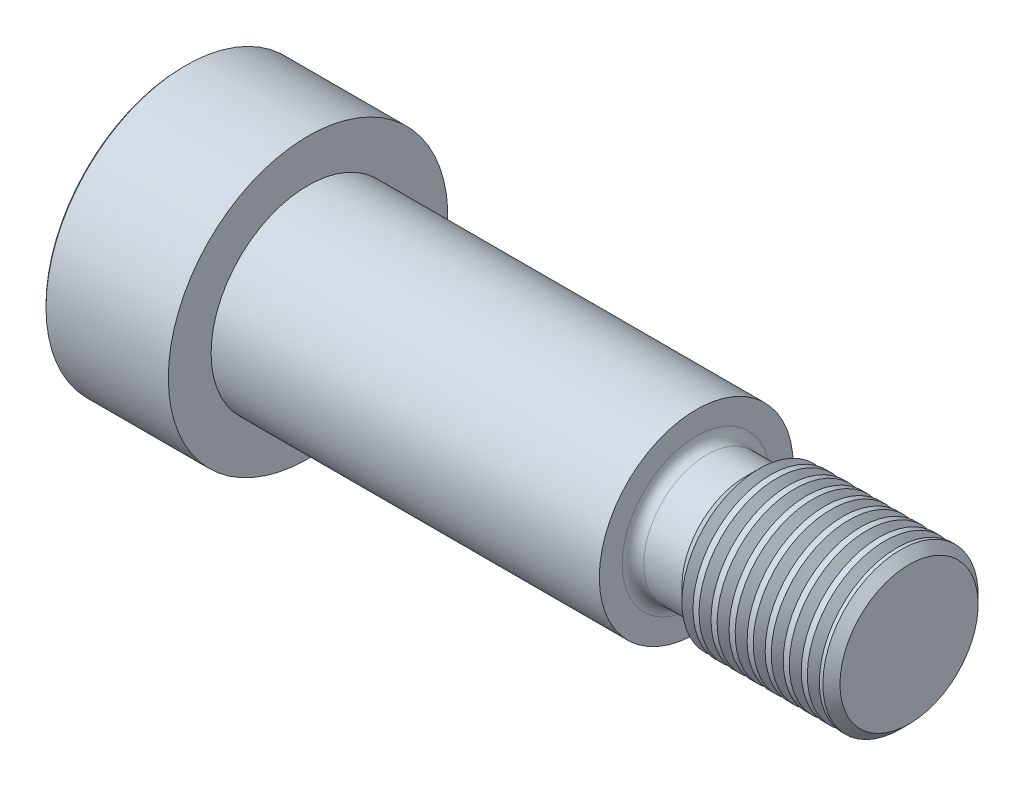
from build123d import *

# Parameters (mm, degrees)
CHAMFER1_SIZE   = 0.25
HEX_2_DEPTH     = 10
THDSCHPAT_COUNT = 8
THDSCHPAT_PITCH = 2.325


with BuildPart() as part:
    # BodySke → BaseBody (revolve)
    with BuildSketch(Plane.XY, mode=Mode.PRIVATE) as basebody_sk:
        with BuildLine():
            Line((0, 0), (0, 18))
            Line((0, 18), (16, 18))
            Line((16, 18), (16, 12.49))
            Line((16, 12.49), (66, 12.49))
            Line((66, 12.49), (66, 9.53))
            ThreePointArc((66, 9.53), (66.404192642, 8.554192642), (67.38, 8.15))
            Line((67.38, 8.15), (72.3, 8.15))
            Line((72.3, 8.15), (74.15, 10))
            Line((74.15, 10), (92.2985, 10))
            Line((92.2985, 10), (93.4, 8.8985))
            Line((93.4, 8.8985), (93.4, 0))
            Line((93.4, 0), (0, 0))
        make_face()
    revolve(basebody_sk.sketch.rotate(Axis((-6.35, 0, 0), (1, 0, 0)), 90), axis=Axis((-6.35, 0, 0), (1, 0, 0)))

    # Chamfer1
    chamfer1_edges = [part.edges().sort_by_distance(p)[0] for p in [
        (0, 0, -18),
    ]]
    chamfer(chamfer1_edges, length=CHAMFER1_SIZE)

    # Sketch2 → PreBroach (revolve, cut)
    with BuildSketch(Plane.XY, mode=Mode.PRIVATE) as prebroach_sk:
        Polygon((0, 6), (10, 6), (13.464101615, 0), (0, 0), align=None)
    revolve(prebroach_sk.sketch.rotate(Axis((0, 0, 0), (1, 0, 0)), 90), axis=Axis((0, 0, 0), (1, 0, 0)), mode=Mode.SUBTRACT)

    # Sketch3 → Hex 2 (cut)
    with BuildSketch(Plane.ZY):
        Polygon((-6, -3.464101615), (-6, 3.464101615), (0, 6.92820323), (6, 3.464101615), (6, -3.464101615), (0, -6.92820323), align=None)
    extrude(amount=-HEX_2_DEPTH, mode=Mode.SUBTRACT)

    # ThdSchSke → ThreadSchematic (revolve, cut)
    with BuildSketch(Plane.XY):
        Polygon((74.8, -8.8985), (72.285204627, -12.49), (72.285204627, -15.6125), (77.314795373, -15.6125), (77.314795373, -12.49), align=None)
    threadschematic = revolve(axis=Axis((-3.175, 0, 0), (1, 0, 0)), mode=Mode.SUBTRACT)

    # ThdSchPat: ThreadSchematic ×8
    with Locations(*[(i * THDSCHPAT_PITCH, 0, 0) for i in range(1, THDSCHPAT_COUNT)]):
        add(threadschematic, mode=Mode.SUBTRACT)


solid = part.part
